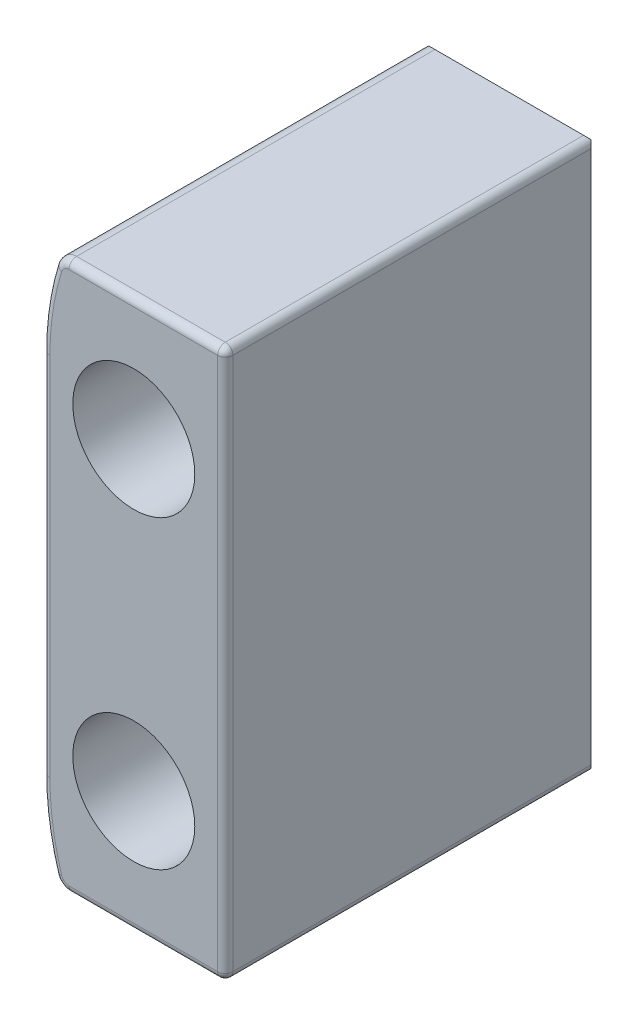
ISO-10303-21;
HEADER;
FILE_DESCRIPTION(('STEP AP214'),'2;1');
FILE_NAME('part.step','',(''),(''),'','','');
FILE_SCHEMA(('AUTOMOTIVE_DESIGN { 1 0 10303 214 1 1 1 1 }'));
ENDSEC;
DATA;
#1=APPLICATION_CONTEXT('core data for automotive mechanical design processes');
#2=APPLICATION_PROTOCOL_DEFINITION('international standard','automotive_design',2000,#1);
#3=PRODUCT_CONTEXT('',#1,'mechanical');
#4=PRODUCT('Part','Part','',(#3));
#5=PRODUCT_RELATED_PRODUCT_CATEGORY('part','',(#4));
#6=PRODUCT_DEFINITION_FORMATION('','',#4);
#7=PRODUCT_DEFINITION_CONTEXT('part definition',#1,'design');
#8=PRODUCT_DEFINITION('design','',#6,#7);
#9=PRODUCT_DEFINITION_SHAPE('','',#8);
#10=(LENGTH_UNIT() NAMED_UNIT(*) SI_UNIT(.MILLI.,.METRE.));
#11=(NAMED_UNIT(*) PLANE_ANGLE_UNIT() SI_UNIT($,.RADIAN.));
#12=(NAMED_UNIT(*) SI_UNIT($,.STERADIAN.) SOLID_ANGLE_UNIT());
#13=UNCERTAINTY_MEASURE_WITH_UNIT(LENGTH_MEASURE(1.E-05),#10,'distance_accuracy_value','');
#14=(GEOMETRIC_REPRESENTATION_CONTEXT(3) GLOBAL_UNCERTAINTY_ASSIGNED_CONTEXT((#13)) GLOBAL_UNIT_ASSIGNED_CONTEXT((#10,
#11,#12)) REPRESENTATION_CONTEXT('',''));
#15=CARTESIAN_POINT('',(0.,0.,0.));
#16=DIRECTION('',(0.,0.,1.));
#17=DIRECTION('',(1.,0.,0.));
#18=AXIS2_PLACEMENT_3D('',#15,#16,#17);
#19=CARTESIAN_POINT('',(0.,0.,0.));
#20=DIRECTION('',(0.,0.,1.));
#21=DIRECTION('',(1.,0.,0.));
#22=AXIS2_PLACEMENT_3D('',#19,#20,#21);
#23=PLANE('',#22);
#24=CARTESIAN_POINT('',(-5.99999999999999,10.,0.));
#25=DIRECTION('',(0.,0.,1.));
#26=DIRECTION('',(1.,0.,0.));
#27=AXIS2_PLACEMENT_3D('',#24,#25,#26);
#28=CIRCLE('',#27,3.99999999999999);
#29=CARTESIAN_POINT('',(-2.,10.,0.));
#30=VERTEX_POINT('',#29);
#31=EDGE_CURVE('E527',#30,#30,#28,.T.);
#32=ORIENTED_EDGE('',*,*,#31,.F.);
#33=EDGE_LOOP('',(#32));
#34=FACE_BOUND('',#33,.T.);
#35=CARTESIAN_POINT('',(-5.99999999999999,-10.,0.));
#36=DIRECTION('',(0.,0.,1.));
#37=DIRECTION('',(1.,0.,0.));
#38=AXIS2_PLACEMENT_3D('',#35,#36,#37);
#39=CIRCLE('',#38,3.99999999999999);
#40=CARTESIAN_POINT('',(-2.,-10.,0.));
#41=VERTEX_POINT('',#40);
#42=EDGE_CURVE('E515',#41,#41,#39,.T.);
#43=ORIENTED_EDGE('',*,*,#42,.F.);
#44=EDGE_LOOP('',(#43));
#45=FACE_BOUND('',#44,.T.);
#46=CARTESIAN_POINT('',(-10.2480768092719,-17.,0.));
#47=DIRECTION('',(0.,0.,1.));
#48=DIRECTION('',(1.,0.,0.));
#49=AXIS2_PLACEMENT_3D('',#46,#47,#48);
#50=CIRCLE('',#49,0.5);
#51=CARTESIAN_POINT('',(-10.2480768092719,-17.5,0.));
#52=VERTEX_POINT('',#51);
#53=CARTESIAN_POINT('',(-10.7259614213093,-17.1470588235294,0.));
#54=VERTEX_POINT('',#53);
#55=EDGE_CURVE('E427',#52,#54,#50,.F.);
#56=ORIENTED_EDGE('',*,*,#55,.F.);
#57=DIRECTION('',(1.,0.,0.));
#58=VECTOR('',#57,1.);
#59=CARTESIAN_POINT('',(0.,-17.5,0.));
#60=LINE('',#59,#58);
#61=CARTESIAN_POINT('',(-0.499999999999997,-17.5,0.));
#62=VERTEX_POINT('',#61);
#63=EDGE_CURVE('E467',#52,#62,#60,.T.);
#64=ORIENTED_EDGE('',*,*,#63,.T.);
#65=DIRECTION('',(0.,1.,0.));
#66=VECTOR('',#65,1.);
#67=CARTESIAN_POINT('',(-0.499999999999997,0.,0.));
#68=LINE('',#67,#66);
#69=CARTESIAN_POINT('',(-0.499999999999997,17.5,0.));
#70=VERTEX_POINT('',#69);
#71=EDGE_CURVE('E471',#62,#70,#68,.T.);
#72=ORIENTED_EDGE('',*,*,#71,.T.);
#73=DIRECTION('',(-1.,0.,0.));
#74=VECTOR('',#73,1.);
#75=CARTESIAN_POINT('',(0.,17.5,0.));
#76=LINE('',#75,#74);
#77=CARTESIAN_POINT('',(-10.2480768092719,17.5,0.));
#78=VERTEX_POINT('',#77);
#79=EDGE_CURVE('E473',#70,#78,#76,.T.);
#80=ORIENTED_EDGE('',*,*,#79,.T.);
#81=CARTESIAN_POINT('',(-10.2480768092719,17.,0.));
#82=DIRECTION('',(0.,0.,1.));
#83=DIRECTION('',(1.,0.,0.));
#84=AXIS2_PLACEMENT_3D('',#81,#82,#83);
#85=CIRCLE('',#84,0.5);
#86=CARTESIAN_POINT('',(-10.7259614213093,17.1470588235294,0.));
#87=VERTEX_POINT('',#86);
#88=EDGE_CURVE('E404',#87,#78,#85,.F.);
#89=ORIENTED_EDGE('',*,*,#88,.F.);
#90=CARTESIAN_POINT('',(6.,12.,0.));
#91=DIRECTION('',(0.,0.,1.));
#92=DIRECTION('',(1.,0.,0.));
#93=AXIS2_PLACEMENT_3D('',#90,#91,#92);
#94=CIRCLE('',#93,17.5);
#95=CARTESIAN_POINT('',(-11.5,12.,0.));
#96=VERTEX_POINT('',#95);
#97=EDGE_CURVE('E479',#87,#96,#94,.T.);
#98=ORIENTED_EDGE('',*,*,#97,.T.);
#99=DIRECTION('',(0.,-1.,0.));
#100=VECTOR('',#99,1.);
#101=CARTESIAN_POINT('',(-11.5,0.,0.));
#102=LINE('',#101,#100);
#103=CARTESIAN_POINT('',(-11.5,-12.,0.));
#104=VERTEX_POINT('',#103);
#105=EDGE_CURVE('E350',#96,#104,#102,.T.);
#106=ORIENTED_EDGE('',*,*,#105,.T.);
#107=CARTESIAN_POINT('',(6.,-12.,0.));
#108=DIRECTION('',(0.,0.,1.));
#109=DIRECTION('',(1.,0.,0.));
#110=AXIS2_PLACEMENT_3D('',#107,#108,#109);
#111=CIRCLE('',#110,17.5);
#112=EDGE_CURVE('E211',#104,#54,#111,.T.);
#113=ORIENTED_EDGE('',*,*,#112,.T.);
#114=EDGE_LOOP('',(#56,#64,#72,#80,#89,#98,#106,#113));
#115=FACE_BOUND('',#114,.T.);
#116=ADVANCED_FACE('F34',(#34,#45,#115),#23,.T.);
#117=CARTESIAN_POINT('',(-12.,18.,-25.));
#118=DIRECTION('',(-1.,0.,0.));
#119=DIRECTION('',(0.,-1.,0.));
#120=AXIS2_PLACEMENT_3D('',#117,#118,#119);
#121=PLANE('',#120);
#122=DIRECTION('',(0.,0.,1.));
#123=VECTOR('',#122,1.);
#124=CARTESIAN_POINT('',(-12.,-12.,-25.));
#125=LINE('',#124,#123);
#126=CARTESIAN_POINT('',(-12.,-12.,-24.));
#127=VERTEX_POINT('',#126);
#128=CARTESIAN_POINT('',(-12.,-12.,-0.5));
#129=VERTEX_POINT('',#128);
#130=EDGE_CURVE('E369',#127,#129,#125,.T.);
#131=ORIENTED_EDGE('',*,*,#130,.T.);
#132=DIRECTION('',(0.,-1.,0.));
#133=VECTOR('',#132,1.);
#134=CARTESIAN_POINT('',(-12.,18.,-0.5));
#135=LINE('',#134,#133);
#136=CARTESIAN_POINT('',(-12.,12.,-0.5));
#137=VERTEX_POINT('',#136);
#138=EDGE_CURVE('E347',#129,#137,#135,.F.);
#139=ORIENTED_EDGE('',*,*,#138,.T.);
#140=DIRECTION('',(0.,0.,1.));
#141=VECTOR('',#140,1.);
#142=CARTESIAN_POINT('',(-12.,12.,-25.));
#143=LINE('',#142,#141);
#144=CARTESIAN_POINT('',(-12.,12.,-24.));
#145=VERTEX_POINT('',#144);
#146=EDGE_CURVE('E366',#145,#137,#143,.T.);
#147=ORIENTED_EDGE('',*,*,#146,.F.);
#148=DIRECTION('',(0.,-1.,0.));
#149=VECTOR('',#148,1.);
#150=CARTESIAN_POINT('',(-12.,-12.,-24.));
#151=LINE('',#150,#149);
#152=EDGE_CURVE('E204',#145,#127,#151,.T.);
#153=ORIENTED_EDGE('',*,*,#152,.T.);
#154=EDGE_LOOP('',(#131,#139,#147,#153));
#155=FACE_BOUND('',#154,.T.);
#156=ADVANCED_FACE('F273',(#155),#121,.T.);
#157=CARTESIAN_POINT('',(-12.,18.,-25.));
#158=DIRECTION('',(0.,1.,0.));
#159=DIRECTION('',(0.,0.,1.));
#160=AXIS2_PLACEMENT_3D('',#157,#158,#159);
#161=PLANE('',#160);
#162=DIRECTION('',(-1.,0.,0.));
#163=VECTOR('',#162,1.);
#164=CARTESIAN_POINT('',(-10.9705627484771,18.,-24.));
#165=LINE('',#164,#163);
#166=CARTESIAN_POINT('',(-0.499999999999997,18.,-24.));
#167=VERTEX_POINT('',#166);
#168=CARTESIAN_POINT('',(-10.2480768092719,18.,-24.));
#169=VERTEX_POINT('',#168);
#170=EDGE_CURVE('E194',#167,#169,#165,.T.);
#171=ORIENTED_EDGE('',*,*,#170,.T.);
#172=DIRECTION('',(0.,0.,-1.));
#173=VECTOR('',#172,1.);
#174=CARTESIAN_POINT('',(-10.2480768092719,18.,-0.5));
#175=LINE('',#174,#173);
#176=CARTESIAN_POINT('',(-10.2480768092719,18.,-0.5));
#177=VERTEX_POINT('',#176);
#178=EDGE_CURVE('E438',#169,#177,#175,.F.);
#179=ORIENTED_EDGE('',*,*,#178,.T.);
#180=DIRECTION('',(-1.,0.,0.));
#181=VECTOR('',#180,1.);
#182=CARTESIAN_POINT('',(-12.,18.,-0.5));
#183=LINE('',#182,#181);
#184=CARTESIAN_POINT('',(-0.499999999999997,18.,-0.5));
#185=VERTEX_POINT('',#184);
#186=EDGE_CURVE('E483',#177,#185,#183,.F.);
#187=ORIENTED_EDGE('',*,*,#186,.T.);
#188=DIRECTION('',(0.,0.,1.));
#189=VECTOR('',#188,1.);
#190=CARTESIAN_POINT('',(-0.499999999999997,18.,-25.));
#191=LINE('',#190,#189);
#192=EDGE_CURVE('E362',#185,#167,#191,.F.);
#193=ORIENTED_EDGE('',*,*,#192,.T.);
#194=EDGE_LOOP('',(#171,#179,#187,#193));
#195=FACE_BOUND('',#194,.T.);
#196=ADVANCED_FACE('F279',(#195),#161,.T.);
#197=CARTESIAN_POINT('',(0.,18.,-25.));
#198=DIRECTION('',(1.,0.,0.));
#199=DIRECTION('',(0.,0.,-1.));
#200=AXIS2_PLACEMENT_3D('',#197,#198,#199);
#201=PLANE('',#200);
#202=DIRECTION('',(0.,1.,0.));
#203=VECTOR('',#202,1.);
#204=CARTESIAN_POINT('',(0.,18.,-24.));
#205=LINE('',#204,#203);
#206=CARTESIAN_POINT('',(0.,-17.5,-24.));
#207=VERTEX_POINT('',#206);
#208=CARTESIAN_POINT('',(0.,17.5,-24.));
#209=VERTEX_POINT('',#208);
#210=EDGE_CURVE('E189',#207,#209,#205,.T.);
#211=ORIENTED_EDGE('',*,*,#210,.T.);
#212=DIRECTION('',(0.,0.,1.));
#213=VECTOR('',#212,1.);
#214=CARTESIAN_POINT('',(0.,17.5,-25.));
#215=LINE('',#214,#213);
#216=CARTESIAN_POINT('',(0.,17.5,-0.5));
#217=VERTEX_POINT('',#216);
#218=EDGE_CURVE('E401',#209,#217,#215,.T.);
#219=ORIENTED_EDGE('',*,*,#218,.T.);
#220=DIRECTION('',(0.,1.,0.));
#221=VECTOR('',#220,1.);
#222=CARTESIAN_POINT('',(0.,18.,-0.5));
#223=LINE('',#222,#221);
#224=CARTESIAN_POINT('',(0.,-17.5,-0.5));
#225=VERTEX_POINT('',#224);
#226=EDGE_CURVE('E487',#217,#225,#223,.F.);
#227=ORIENTED_EDGE('',*,*,#226,.T.);
#228=DIRECTION('',(0.,0.,1.));
#229=VECTOR('',#228,1.);
#230=CARTESIAN_POINT('',(0.,-17.5,-25.));
#231=LINE('',#230,#229);
#232=EDGE_CURVE('E485',#225,#207,#231,.F.);
#233=ORIENTED_EDGE('',*,*,#232,.T.);
#234=EDGE_LOOP('',(#211,#219,#227,#233));
#235=FACE_BOUND('',#234,.T.);
#236=ADVANCED_FACE('F289',(#235),#201,.T.);
#237=CARTESIAN_POINT('',(-12.,-18.,-25.));
#238=DIRECTION('',(0.,-1.,0.));
#239=DIRECTION('',(0.,0.,-1.));
#240=AXIS2_PLACEMENT_3D('',#237,#238,#239);
#241=PLANE('',#240);
#242=DIRECTION('',(1.,0.,0.));
#243=VECTOR('',#242,1.);
#244=CARTESIAN_POINT('',(-12.,-18.,-0.5));
#245=LINE('',#244,#243);
#246=CARTESIAN_POINT('',(-0.499999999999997,-18.,-0.5));
#247=VERTEX_POINT('',#246);
#248=CARTESIAN_POINT('',(-10.2480768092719,-18.,-0.5));
#249=VERTEX_POINT('',#248);
#250=EDGE_CURVE('E460',#247,#249,#245,.F.);
#251=ORIENTED_EDGE('',*,*,#250,.T.);
#252=DIRECTION('',(0.,0.,-1.));
#253=VECTOR('',#252,1.);
#254=CARTESIAN_POINT('',(-10.2480768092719,-18.,-24.));
#255=LINE('',#254,#253);
#256=CARTESIAN_POINT('',(-10.2480768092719,-18.,-24.));
#257=VERTEX_POINT('',#256);
#258=EDGE_CURVE('E59',#249,#257,#255,.T.);
#259=ORIENTED_EDGE('',*,*,#258,.T.);
#260=DIRECTION('',(1.,0.,0.));
#261=VECTOR('',#260,1.);
#262=CARTESIAN_POINT('',(0.,-18.,-24.));
#263=LINE('',#262,#261);
#264=CARTESIAN_POINT('',(-0.499999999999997,-18.,-24.));
#265=VERTEX_POINT('',#264);
#266=EDGE_CURVE('E209',#257,#265,#263,.T.);
#267=ORIENTED_EDGE('',*,*,#266,.T.);
#268=DIRECTION('',(0.,0.,1.));
#269=VECTOR('',#268,1.);
#270=CARTESIAN_POINT('',(-0.499999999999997,-18.,-25.));
#271=LINE('',#270,#269);
#272=EDGE_CURVE('E490',#265,#247,#271,.T.);
#273=ORIENTED_EDGE('',*,*,#272,.T.);
#274=EDGE_LOOP('',(#251,#259,#267,#273));
#275=FACE_BOUND('',#274,.T.);
#276=ADVANCED_FACE('F293',(#275),#241,.T.);
#277=CARTESIAN_POINT('',(0.,0.,-25.));
#278=DIRECTION('',(0.,0.,1.));
#279=DIRECTION('',(1.,0.,0.));
#280=AXIS2_PLACEMENT_3D('',#277,#278,#279);
#281=PLANE('',#280);
#282=CARTESIAN_POINT('',(-5.99999999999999,10.,-25.));
#283=DIRECTION('',(0.,0.,1.));
#284=DIRECTION('',(1.,0.,0.));
#285=AXIS2_PLACEMENT_3D('',#282,#283,#284);
#286=CIRCLE('',#285,2.49999999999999);
#287=CARTESIAN_POINT('',(-3.5,10.,-25.));
#288=VERTEX_POINT('',#287);
#289=EDGE_CURVE('E518',#288,#288,#286,.T.);
#290=ORIENTED_EDGE('',*,*,#289,.T.);
#291=EDGE_LOOP('',(#290));
#292=FACE_BOUND('',#291,.T.);
#293=CARTESIAN_POINT('',(-5.99999999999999,-10.,-25.));
#294=DIRECTION('',(0.,0.,1.));
#295=DIRECTION('',(1.,0.,0.));
#296=AXIS2_PLACEMENT_3D('',#293,#294,#295);
#297=CIRCLE('',#296,2.49999999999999);
#298=CARTESIAN_POINT('',(-3.5,-10.,-25.));
#299=VERTEX_POINT('',#298);
#300=EDGE_CURVE('E504',#299,#299,#297,.T.);
#301=ORIENTED_EDGE('',*,*,#300,.T.);
#302=EDGE_LOOP('',(#301));
#303=FACE_BOUND('',#302,.T.);
#304=DIRECTION('',(1.,0.,0.));
#305=VECTOR('',#304,1.);
#306=CARTESIAN_POINT('',(0.,17.,-25.));
#307=LINE('',#306,#305);
#308=CARTESIAN_POINT('',(-10.2480768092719,17.,-25.));
#309=VERTEX_POINT('',#308);
#310=CARTESIAN_POINT('',(-1.00000000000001,17.,-25.));
#311=VERTEX_POINT('',#310);
#312=EDGE_CURVE('E193',#309,#311,#307,.T.);
#313=ORIENTED_EDGE('',*,*,#312,.T.);
#314=DIRECTION('',(0.,-1.,0.));
#315=VECTOR('',#314,1.);
#316=CARTESIAN_POINT('',(-1.00000000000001,-18.,-25.));
#317=LINE('',#316,#315);
#318=CARTESIAN_POINT('',(-1.00000000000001,-17.,-25.));
#319=VERTEX_POINT('',#318);
#320=EDGE_CURVE('E172',#311,#319,#317,.T.);
#321=ORIENTED_EDGE('',*,*,#320,.T.);
#322=DIRECTION('',(-1.,0.,0.));
#323=VECTOR('',#322,1.);
#324=CARTESIAN_POINT('',(-10.9705627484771,-17.,-25.));
#325=LINE('',#324,#323);
#326=CARTESIAN_POINT('',(-10.2480768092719,-17.,-25.));
#327=VERTEX_POINT('',#326);
#328=EDGE_CURVE('E183',#319,#327,#325,.T.);
#329=ORIENTED_EDGE('',*,*,#328,.T.);
#330=CARTESIAN_POINT('',(6.,-12.,-25.));
#331=DIRECTION('',(0.,0.,1.));
#332=DIRECTION('',(1.,0.,0.));
#333=AXIS2_PLACEMENT_3D('',#330,#331,#332);
#334=CIRCLE('',#333,17.);
#335=CARTESIAN_POINT('',(-11.,-12.,-25.));
#336=VERTEX_POINT('',#335);
#337=EDGE_CURVE('E188',#327,#336,#334,.F.);
#338=ORIENTED_EDGE('',*,*,#337,.T.);
#339=DIRECTION('',(0.,1.,0.));
#340=VECTOR('',#339,1.);
#341=CARTESIAN_POINT('',(-11.,12.,-25.));
#342=LINE('',#341,#340);
#343=CARTESIAN_POINT('',(-11.,12.,-25.));
#344=VERTEX_POINT('',#343);
#345=EDGE_CURVE('E384',#336,#344,#342,.T.);
#346=ORIENTED_EDGE('',*,*,#345,.T.);
#347=CARTESIAN_POINT('',(6.,12.,-25.));
#348=DIRECTION('',(0.,0.,1.));
#349=DIRECTION('',(1.,0.,0.));
#350=AXIS2_PLACEMENT_3D('',#347,#348,#349);
#351=CIRCLE('',#350,17.);
#352=EDGE_CURVE('E199',#344,#309,#351,.F.);
#353=ORIENTED_EDGE('',*,*,#352,.T.);
#354=EDGE_LOOP('',(#313,#321,#329,#338,#346,#353));
#355=FACE_BOUND('',#354,.T.);
#356=ADVANCED_FACE('F191',(#292,#303,#355),#281,.F.);
#357=CARTESIAN_POINT('',(6.,12.,-25.));
#358=DIRECTION('',(0.,0.,1.));
#359=DIRECTION('',(1.,0.,0.));
#360=AXIS2_PLACEMENT_3D('',#357,#358,#359);
#361=CYLINDRICAL_SURFACE('',#360,18.);
#362=CARTESIAN_POINT('',(6.,12.,-0.5));
#363=DIRECTION('',(0.,0.,1.));
#364=DIRECTION('',(1.,0.,0.));
#365=AXIS2_PLACEMENT_3D('',#362,#363,#364);
#366=CIRCLE('',#365,18.);
#367=CARTESIAN_POINT('',(-11.2038460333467,17.2941176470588,-0.5));
#368=VERTEX_POINT('',#367);
#369=EDGE_CURVE('E356',#137,#368,#366,.F.);
#370=ORIENTED_EDGE('',*,*,#369,.T.);
#371=DIRECTION('',(0.,0.,1.));
#372=VECTOR('',#371,1.);
#373=CARTESIAN_POINT('',(-11.2038460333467,17.2941176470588,-25.));
#374=LINE('',#373,#372);
#375=CARTESIAN_POINT('',(-11.2038460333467,17.2941176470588,-24.));
#376=VERTEX_POINT('',#375);
#377=EDGE_CURVE('E440',#368,#376,#374,.F.);
#378=ORIENTED_EDGE('',*,*,#377,.T.);
#379=CARTESIAN_POINT('',(6.,12.,-24.));
#380=DIRECTION('',(0.,0.,1.));
#381=DIRECTION('',(1.,0.,0.));
#382=AXIS2_PLACEMENT_3D('',#379,#380,#381);
#383=CIRCLE('',#382,18.);
#384=EDGE_CURVE('E197',#376,#145,#383,.T.);
#385=ORIENTED_EDGE('',*,*,#384,.T.);
#386=ORIENTED_EDGE('',*,*,#146,.T.);
#387=EDGE_LOOP('',(#370,#378,#385,#386));
#388=FACE_BOUND('',#387,.T.);
#389=ADVANCED_FACE('F371',(#388),#361,.T.);
#390=CARTESIAN_POINT('',(6.,-12.,-25.));
#391=DIRECTION('',(0.,0.,1.));
#392=DIRECTION('',(1.,0.,0.));
#393=AXIS2_PLACEMENT_3D('',#390,#391,#392);
#394=CYLINDRICAL_SURFACE('',#393,18.);
#395=CARTESIAN_POINT('',(6.,-12.,-24.));
#396=DIRECTION('',(0.,0.,1.));
#397=DIRECTION('',(1.,0.,0.));
#398=AXIS2_PLACEMENT_3D('',#395,#396,#397);
#399=CIRCLE('',#398,18.);
#400=CARTESIAN_POINT('',(-11.2038460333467,-17.2941176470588,-24.));
#401=VERTEX_POINT('',#400);
#402=EDGE_CURVE('E206',#127,#401,#399,.T.);
#403=ORIENTED_EDGE('',*,*,#402,.T.);
#404=DIRECTION('',(0.,0.,1.));
#405=VECTOR('',#404,1.);
#406=CARTESIAN_POINT('',(-11.2038460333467,-17.2941176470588,-25.));
#407=LINE('',#406,#405);
#408=CARTESIAN_POINT('',(-11.2038460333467,-17.2941176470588,-0.5));
#409=VERTEX_POINT('',#408);
#410=EDGE_CURVE('E448',#401,#409,#407,.T.);
#411=ORIENTED_EDGE('',*,*,#410,.T.);
#412=CARTESIAN_POINT('',(6.,-12.,-0.5));
#413=DIRECTION('',(0.,0.,1.));
#414=DIRECTION('',(1.,0.,0.));
#415=AXIS2_PLACEMENT_3D('',#412,#413,#414);
#416=CIRCLE('',#415,18.);
#417=EDGE_CURVE('E453',#409,#129,#416,.F.);
#418=ORIENTED_EDGE('',*,*,#417,.T.);
#419=ORIENTED_EDGE('',*,*,#130,.F.);
#420=EDGE_LOOP('',(#403,#411,#418,#419));
#421=FACE_BOUND('',#420,.T.);
#422=ADVANCED_FACE('F452',(#421),#394,.T.);
#423=CARTESIAN_POINT('',(-12.,18.,-24.));
#424=DIRECTION('',(-0.707106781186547,0.,-0.707106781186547));
#425=DIRECTION('',(0.,1.,0.));
#426=AXIS2_PLACEMENT_3D('',#423,#424,#425);
#427=PLANE('',#426);
#428=DIRECTION('',(-0.707106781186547,0.,0.707106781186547));
#429=VECTOR('',#428,1.);
#430=CARTESIAN_POINT('',(-11.,12.,-25.));
#431=LINE('',#430,#429);
#432=EDGE_CURVE('E377',#344,#145,#431,.T.);
#433=ORIENTED_EDGE('',*,*,#432,.F.);
#434=ORIENTED_EDGE('',*,*,#345,.F.);
#435=DIRECTION('',(0.707106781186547,0.,-0.707106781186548));
#436=VECTOR('',#435,1.);
#437=CARTESIAN_POINT('',(-12.,-12.,-24.));
#438=LINE('',#437,#436);
#439=EDGE_CURVE('E373',#127,#336,#438,.T.);
#440=ORIENTED_EDGE('',*,*,#439,.F.);
#441=ORIENTED_EDGE('',*,*,#152,.F.);
#442=EDGE_LOOP('',(#433,#434,#440,#441));
#443=FACE_BOUND('',#442,.T.);
#444=ADVANCED_FACE('F240',(#443),#427,.T.);
#445=CARTESIAN_POINT('',(6.,-12.,-25.));
#446=DIRECTION('',(0.,0.,1.));
#447=DIRECTION('',(1.,0.,0.));
#448=AXIS2_PLACEMENT_3D('',#445,#446,#447);
#449=CONICAL_SURFACE('',#448,17.,0.785398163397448);
#450=CARTESIAN_POINT('',(-10.9705627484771,-18.,-24.));
#451=CARTESIAN_POINT('',(-10.8522252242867,-17.8325832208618,-24.1674167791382));
#452=CARTESIAN_POINT('',(-10.7328493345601,-17.6655415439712,-24.3344584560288));
#453=CARTESIAN_POINT('',(-10.4920206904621,-17.3322082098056,-24.6677917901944));
#454=CARTESIAN_POINT('',(-10.3705679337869,-17.1659165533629,-24.834083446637));
#455=CARTESIAN_POINT('',(-10.2480768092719,-17.,-25.));
#456=B_SPLINE_CURVE_WITH_KNOTS('',3,(#450,#451,#452,#453,#454,#455),.UNSPECIFIED.,.F.,.F.,(4,2,
4),(0.,0.794045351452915,1.58809158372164),.UNSPECIFIED.);
#457=CARTESIAN_POINT('',(-10.8352779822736,-17.8094410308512,-24.1905589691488));
#458=VERTEX_POINT('',#457);
#459=EDGE_CURVE('E185',#458,#327,#456,.T.);
#460=ORIENTED_EDGE('',*,*,#459,.F.);
#461=CARTESIAN_POINT('',(-10.8352779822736,-17.8094410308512,-24.1905589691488));
#462=CARTESIAN_POINT('',(-10.869993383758,-17.7842897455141,-24.165947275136));
#463=CARTESIAN_POINT('',(-10.9039362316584,-17.7562251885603,-24.1429115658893));
#464=CARTESIAN_POINT('',(-10.9693859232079,-17.6940874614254,-24.1008076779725));
#465=CARTESIAN_POINT('',(-11.0008651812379,-17.6599573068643,-24.0817812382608));
#466=CARTESIAN_POINT('',(-11.059953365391,-17.5857648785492,-24.0489334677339));
#467=CARTESIAN_POINT('',(-11.0875351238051,-17.545664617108,-24.0351476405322));
#468=CARTESIAN_POINT('',(-11.1369487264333,-17.4607522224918,-24.0141012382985));
#469=CARTESIAN_POINT('',(-11.1588153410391,-17.4159710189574,-24.006800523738));
#470=CARTESIAN_POINT('',(-11.1821787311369,-17.3572587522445,-24.0020193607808));
#471=CARTESIAN_POINT('',(-11.1868603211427,-17.3447677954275,-24.0012630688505));
#472=CARTESIAN_POINT('',(-11.195727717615,-17.3195854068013,-24.0002537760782));
#473=CARTESIAN_POINT('',(-11.1999133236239,-17.3068938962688,-24.000000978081));
#474=CARTESIAN_POINT('',(-11.2038460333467,-17.2941176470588,-24.));
#475=B_SPLINE_CURVE_WITH_KNOTS('',3,(#461,#462,#463,#464,#465,#466,#467,#468,#469,#470,#471,
#472,#473,#474),.UNSPECIFIED.,.F.,.F.,(4,2,2,2,2,2,4),(0.,0.148421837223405,0.298319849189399,
0.449216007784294,0.599171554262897,0.639240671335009,0.679325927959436),.UNSPECIFIED.);
#476=EDGE_CURVE('E11',#458,#401,#475,.T.);
#477=ORIENTED_EDGE('',*,*,#476,.T.);
#478=ORIENTED_EDGE('',*,*,#402,.F.);
#479=ORIENTED_EDGE('',*,*,#439,.T.);
#480=ORIENTED_EDGE('',*,*,#337,.F.);
#481=EDGE_LOOP('',(#460,#477,#478,#479,#480));
#482=FACE_BOUND('',#481,.T.);
#483=ADVANCED_FACE('F236',(#482),#449,.T.);
#484=CARTESIAN_POINT('',(6.,12.,-25.));
#485=DIRECTION('',(0.,0.,1.));
#486=DIRECTION('',(1.,0.,0.));
#487=AXIS2_PLACEMENT_3D('',#484,#485,#486);
#488=CONICAL_SURFACE('',#487,17.,0.785398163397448);
#489=ORIENTED_EDGE('',*,*,#384,.F.);
#490=CARTESIAN_POINT('',(-11.2038460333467,17.2941176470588,-24.));
#491=CARTESIAN_POINT('',(-11.1971583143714,17.3158594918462,-23.9999975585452));
#492=CARTESIAN_POINT('',(-11.1897269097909,17.3373580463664,-24.0007336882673));
#493=CARTESIAN_POINT('',(-11.1734632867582,17.3797015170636,-24.0036526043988));
#494=CARTESIAN_POINT('',(-11.1646320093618,17.4005468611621,-24.0058344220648));
#495=CARTESIAN_POINT('',(-11.1363222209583,17.4615316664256,-24.0144527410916));
#496=CARTESIAN_POINT('',(-11.1149055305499,17.5005124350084,-24.0229633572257));
#497=CARTESIAN_POINT('',(-11.0679699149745,17.5741826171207,-24.0449083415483));
#498=CARTESIAN_POINT('',(-11.0424605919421,17.6088817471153,-24.0583312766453));
#499=CARTESIAN_POINT('',(-10.9882656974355,17.6737275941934,-24.0893660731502));
#500=CARTESIAN_POINT('',(-10.9595735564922,17.7038645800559,-24.1069866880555));
#501=CARTESIAN_POINT('',(-10.9145210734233,17.745848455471,-24.1361969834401));
#502=CARTESIAN_POINT('',(-10.8989538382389,17.7594594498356,-24.1465490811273));
#503=CARTESIAN_POINT('',(-10.8674121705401,17.7853902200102,-24.1680053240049));
#504=CARTESIAN_POINT('',(-10.8514397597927,17.7977152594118,-24.1791060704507));
#505=CARTESIAN_POINT('',(-10.8352779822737,17.8094410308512,-24.1905589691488));
#506=B_SPLINE_CURVE_WITH_KNOTS('',3,(#490,#491,#492,#493,#494,#495,#496,#497,#498,#499,#500,
#501,#502,#503,#504,#505),.UNSPECIFIED.,.F.,.F.,(4,2,2,2,2,2,2,4),(0.,0.0681899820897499,
0.136334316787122,0.271408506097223,0.406170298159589,0.541215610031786,0.61054745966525,
0.67958336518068),.UNSPECIFIED.);
#507=CARTESIAN_POINT('',(-10.8352779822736,17.8094410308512,-24.1905589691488));
#508=VERTEX_POINT('',#507);
#509=EDGE_CURVE('E392',#376,#508,#506,.T.);
#510=ORIENTED_EDGE('',*,*,#509,.T.);
#511=CARTESIAN_POINT('',(-10.9705627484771,18.,-24.));
#512=CARTESIAN_POINT('',(-10.8522252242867,17.8325832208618,-24.1674167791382));
#513=CARTESIAN_POINT('',(-10.7328493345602,17.6655415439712,-24.3344584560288));
#514=CARTESIAN_POINT('',(-10.4920206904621,17.3322082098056,-24.6677917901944));
#515=CARTESIAN_POINT('',(-10.3705679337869,17.1659165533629,-24.834083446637));
#516=CARTESIAN_POINT('',(-10.2480768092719,17.,-25.));
#517=B_SPLINE_CURVE_WITH_KNOTS('',3,(#511,#512,#513,#514,#515,#516),.UNSPECIFIED.,.F.,.F.,(4,2,
4),(0.,0.79404535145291,1.58809158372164),.UNSPECIFIED.);
#518=EDGE_CURVE('E179',#309,#508,#517,.F.);
#519=ORIENTED_EDGE('',*,*,#518,.F.);
#520=ORIENTED_EDGE('',*,*,#352,.F.);
#521=ORIENTED_EDGE('',*,*,#432,.T.);
#522=EDGE_LOOP('',(#489,#510,#519,#520,#521));
#523=FACE_BOUND('',#522,.T.);
#524=ADVANCED_FACE('F227',(#523),#488,.T.);
#525=CARTESIAN_POINT('',(-12.,-18.,-24.));
#526=DIRECTION('',(0.,-0.707106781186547,-0.707106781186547));
#527=DIRECTION('',(-1.,0.,0.));
#528=AXIS2_PLACEMENT_3D('',#525,#526,#527);
#529=PLANE('',#528);
#530=ORIENTED_EDGE('',*,*,#266,.F.);
#531=CARTESIAN_POINT('',(-10.2480768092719,-17.,-25.));
#532=DIRECTION('',(0.,-0.707106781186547,-0.707106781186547));
#533=DIRECTION('',(0.,-0.707106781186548,0.707106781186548));
#534=AXIS2_PLACEMENT_3D('',#531,#532,#533);
#535=ELLIPSE('',#534,1.4142135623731,1.);
#536=EDGE_CURVE('E44',#257,#458,#535,.T.);
#537=ORIENTED_EDGE('',*,*,#536,.T.);
#538=ORIENTED_EDGE('',*,*,#459,.T.);
#539=ORIENTED_EDGE('',*,*,#328,.F.);
#540=DIRECTION('',(0.577350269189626,-0.577350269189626,0.577350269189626));
#541=VECTOR('',#540,1.);
#542=CARTESIAN_POINT('',(-3.99999999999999,-14.,-28.));
#543=LINE('',#542,#541);
#544=CARTESIAN_POINT('',(-0.146446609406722,-17.8535533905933,-24.1464466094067));
#545=VERTEX_POINT('',#544);
#546=EDGE_CURVE('E167',#545,#319,#543,.F.);
#547=ORIENTED_EDGE('',*,*,#546,.F.);
#548=CARTESIAN_POINT('',(-0.499999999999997,-17.5,-24.5));
#549=DIRECTION('',(0.,-0.707106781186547,-0.707106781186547));
#550=DIRECTION('',(0.,-0.707106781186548,0.707106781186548));
#551=AXIS2_PLACEMENT_3D('',#548,#549,#550);
#552=ELLIPSE('',#551,0.707106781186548,0.5);
#553=EDGE_CURVE('E402',#545,#265,#552,.T.);
#554=ORIENTED_EDGE('',*,*,#553,.T.);
#555=EDGE_LOOP('',(#530,#537,#538,#539,#547,#554));
#556=FACE_BOUND('',#555,.T.);
#557=ADVANCED_FACE('F184',(#556),#529,.T.);
#558=CARTESIAN_POINT('',(-12.,18.,-24.));
#559=DIRECTION('',(0.,0.707106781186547,-0.707106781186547));
#560=DIRECTION('',(1.,0.,0.));
#561=AXIS2_PLACEMENT_3D('',#558,#559,#560);
#562=PLANE('',#561);
#563=ORIENTED_EDGE('',*,*,#518,.T.);
#564=CARTESIAN_POINT('',(-10.2480768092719,17.,-25.));
#565=DIRECTION('',(0.,0.707106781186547,-0.707106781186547));
#566=DIRECTION('',(0.,0.707106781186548,0.707106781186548));
#567=AXIS2_PLACEMENT_3D('',#564,#565,#566);
#568=ELLIPSE('',#567,1.4142135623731,1.);
#569=EDGE_CURVE('E446',#508,#169,#568,.T.);
#570=ORIENTED_EDGE('',*,*,#569,.T.);
#571=ORIENTED_EDGE('',*,*,#170,.F.);
#572=CARTESIAN_POINT('',(-0.499999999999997,17.5,-24.5));
#573=DIRECTION('',(0.,0.707106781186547,-0.707106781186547));
#574=DIRECTION('',(0.,0.707106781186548,0.707106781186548));
#575=AXIS2_PLACEMENT_3D('',#572,#573,#574);
#576=ELLIPSE('',#575,0.707106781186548,0.5);
#577=CARTESIAN_POINT('',(-0.146446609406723,17.8535533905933,-24.1464466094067));
#578=VERTEX_POINT('',#577);
#579=EDGE_CURVE('E395',#167,#578,#576,.T.);
#580=ORIENTED_EDGE('',*,*,#579,.T.);
#581=DIRECTION('',(-0.577350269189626,-0.577350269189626,-0.577350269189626));
#582=VECTOR('',#581,1.);
#583=CARTESIAN_POINT('',(-4.,14.,-28.));
#584=LINE('',#583,#582);
#585=EDGE_CURVE('E180',#311,#578,#584,.F.);
#586=ORIENTED_EDGE('',*,*,#585,.F.);
#587=ORIENTED_EDGE('',*,*,#312,.F.);
#588=EDGE_LOOP('',(#563,#570,#571,#580,#586,#587));
#589=FACE_BOUND('',#588,.T.);
#590=ADVANCED_FACE('F230',(#589),#562,.T.);
#591=CARTESIAN_POINT('',(0.,18.,-24.));
#592=DIRECTION('',(0.707106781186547,0.,-0.707106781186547));
#593=DIRECTION('',(0.,-1.,0.));
#594=AXIS2_PLACEMENT_3D('',#591,#592,#593);
#595=PLANE('',#594);
#596=ORIENTED_EDGE('',*,*,#585,.T.);
#597=CARTESIAN_POINT('',(-0.499999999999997,17.5,-24.5));
#598=DIRECTION('',(0.707106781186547,0.,-0.707106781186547));
#599=DIRECTION('',(0.707106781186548,0.,0.707106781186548));
#600=AXIS2_PLACEMENT_3D('',#597,#598,#599);
#601=ELLIPSE('',#600,0.707106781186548,0.5);
#602=EDGE_CURVE('E397',#578,#209,#601,.T.);
#603=ORIENTED_EDGE('',*,*,#602,.T.);
#604=ORIENTED_EDGE('',*,*,#210,.F.);
#605=CARTESIAN_POINT('',(-0.499999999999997,-17.5,-24.5));
#606=DIRECTION('',(0.707106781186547,0.,-0.707106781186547));
#607=DIRECTION('',(0.707106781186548,0.,0.707106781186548));
#608=AXIS2_PLACEMENT_3D('',#605,#606,#607);
#609=ELLIPSE('',#608,0.707106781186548,0.5);
#610=EDGE_CURVE('E176',#207,#545,#609,.T.);
#611=ORIENTED_EDGE('',*,*,#610,.T.);
#612=ORIENTED_EDGE('',*,*,#546,.T.);
#613=ORIENTED_EDGE('',*,*,#320,.F.);
#614=EDGE_LOOP('',(#596,#603,#604,#611,#612,#613));
#615=FACE_BOUND('',#614,.T.);
#616=ADVANCED_FACE('F170',(#615),#595,.T.);
#617=CARTESIAN_POINT('',(-0.499999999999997,17.5,-25.));
#618=DIRECTION('',(0.,0.,1.));
#619=DIRECTION('',(1.,0.,0.));
#620=AXIS2_PLACEMENT_3D('',#617,#618,#619);
#621=CYLINDRICAL_SURFACE('',#620,0.5);
#622=ORIENTED_EDGE('',*,*,#579,.F.);
#623=ORIENTED_EDGE('',*,*,#192,.F.);
#624=CARTESIAN_POINT('',(-0.499999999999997,17.5,-0.5));
#625=DIRECTION('',(0.,0.,1.));
#626=DIRECTION('',(1.,0.,0.));
#627=AXIS2_PLACEMENT_3D('',#624,#625,#626);
#628=CIRCLE('',#627,0.5);
#629=EDGE_CURVE('E212',#217,#185,#628,.T.);
#630=ORIENTED_EDGE('',*,*,#629,.F.);
#631=ORIENTED_EDGE('',*,*,#218,.F.);
#632=ORIENTED_EDGE('',*,*,#602,.F.);
#633=EDGE_LOOP('',(#622,#623,#630,#631,#632));
#634=FACE_BOUND('',#633,.T.);
#635=ADVANCED_FACE('F297',(#634),#621,.T.);
#636=CARTESIAN_POINT('',(-0.499999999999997,0.,-0.5));
#637=DIRECTION('',(0.,1.,0.));
#638=DIRECTION('',(0.,0.,1.));
#639=AXIS2_PLACEMENT_3D('',#636,#637,#638);
#640=CYLINDRICAL_SURFACE('',#639,0.5);
#641=CARTESIAN_POINT('',(-0.499999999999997,-17.5,-0.5));
#642=DIRECTION('',(0.,-1.,0.));
#643=DIRECTION('',(0.,0.,-1.));
#644=AXIS2_PLACEMENT_3D('',#641,#642,#643);
#645=CIRCLE('',#644,0.5);
#646=EDGE_CURVE('E418',#225,#62,#645,.T.);
#647=ORIENTED_EDGE('',*,*,#646,.F.);
#648=ORIENTED_EDGE('',*,*,#226,.F.);
#649=CARTESIAN_POINT('',(-0.499999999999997,17.5,-0.5));
#650=DIRECTION('',(0.,1.,0.));
#651=DIRECTION('',(0.,0.,1.));
#652=AXIS2_PLACEMENT_3D('',#649,#650,#651);
#653=CIRCLE('',#652,0.5);
#654=EDGE_CURVE('E421',#70,#217,#653,.T.);
#655=ORIENTED_EDGE('',*,*,#654,.F.);
#656=ORIENTED_EDGE('',*,*,#71,.F.);
#657=EDGE_LOOP('',(#647,#648,#655,#656));
#658=FACE_BOUND('',#657,.T.);
#659=ADVANCED_FACE('F301',(#658),#640,.T.);
#660=CARTESIAN_POINT('',(-0.499999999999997,-17.5,-25.));
#661=DIRECTION('',(0.,0.,1.));
#662=DIRECTION('',(1.,0.,0.));
#663=AXIS2_PLACEMENT_3D('',#660,#661,#662);
#664=CYLINDRICAL_SURFACE('',#663,0.5);
#665=ORIENTED_EDGE('',*,*,#610,.F.);
#666=ORIENTED_EDGE('',*,*,#232,.F.);
#667=CARTESIAN_POINT('',(-0.499999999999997,-17.5,-0.5));
#668=DIRECTION('',(0.,0.,1.));
#669=DIRECTION('',(1.,0.,0.));
#670=AXIS2_PLACEMENT_3D('',#667,#668,#669);
#671=CIRCLE('',#670,0.5);
#672=EDGE_CURVE('E415',#247,#225,#671,.T.);
#673=ORIENTED_EDGE('',*,*,#672,.F.);
#674=ORIENTED_EDGE('',*,*,#272,.F.);
#675=ORIENTED_EDGE('',*,*,#553,.F.);
#676=EDGE_LOOP('',(#665,#666,#673,#674,#675));
#677=FACE_BOUND('',#676,.T.);
#678=ADVANCED_FACE('F306',(#677),#664,.T.);
#679=CARTESIAN_POINT('',(-0.499999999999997,17.5,-0.5));
#680=DIRECTION('',(0.,0.,1.));
#681=DIRECTION('',(1.,0.,0.));
#682=AXIS2_PLACEMENT_3D('',#679,#680,#681);
#683=SPHERICAL_SURFACE('',#682,0.5);
#684=ORIENTED_EDGE('',*,*,#654,.T.);
#685=ORIENTED_EDGE('',*,*,#629,.T.);
#686=CARTESIAN_POINT('',(-0.499999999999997,17.5,-0.5));
#687=DIRECTION('',(1.,0.,0.));
#688=DIRECTION('',(0.,0.,-1.));
#689=AXIS2_PLACEMENT_3D('',#686,#687,#688);
#690=CIRCLE('',#689,0.5);
#691=EDGE_CURVE('E412',#70,#185,#690,.F.);
#692=ORIENTED_EDGE('',*,*,#691,.F.);
#693=EDGE_LOOP('',(#684,#685,#692));
#694=FACE_BOUND('',#693,.T.);
#695=ADVANCED_FACE('F313',(#694),#683,.T.);
#696=CARTESIAN_POINT('',(-0.499999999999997,-17.5,-0.5));
#697=DIRECTION('',(0.,0.,1.));
#698=DIRECTION('',(1.,0.,0.));
#699=AXIS2_PLACEMENT_3D('',#696,#697,#698);
#700=SPHERICAL_SURFACE('',#699,0.5);
#701=ORIENTED_EDGE('',*,*,#672,.T.);
#702=ORIENTED_EDGE('',*,*,#646,.T.);
#703=CARTESIAN_POINT('',(-0.499999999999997,-17.5,-0.5));
#704=DIRECTION('',(1.,0.,0.));
#705=DIRECTION('',(0.,1.,0.));
#706=AXIS2_PLACEMENT_3D('',#703,#704,#705);
#707=CIRCLE('',#706,0.5);
#708=EDGE_CURVE('E352',#247,#62,#707,.F.);
#709=ORIENTED_EDGE('',*,*,#708,.F.);
#710=EDGE_LOOP('',(#701,#702,#709));
#711=FACE_BOUND('',#710,.T.);
#712=ADVANCED_FACE('F317',(#711),#700,.T.);
#713=CARTESIAN_POINT('',(0.,17.5,-0.5));
#714=DIRECTION('',(-1.,0.,0.));
#715=DIRECTION('',(0.,0.,1.));
#716=AXIS2_PLACEMENT_3D('',#713,#714,#715);
#717=CYLINDRICAL_SURFACE('',#716,0.5);
#718=ORIENTED_EDGE('',*,*,#186,.F.);
#719=CARTESIAN_POINT('',(-10.2480768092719,17.5,-0.5));
#720=DIRECTION('',(1.,0.,0.));
#721=DIRECTION('',(0.,0.,-1.));
#722=AXIS2_PLACEMENT_3D('',#719,#720,#721);
#723=CIRCLE('',#722,0.5);
#724=EDGE_CURVE('E432',#177,#78,#723,.T.);
#725=ORIENTED_EDGE('',*,*,#724,.T.);
#726=ORIENTED_EDGE('',*,*,#79,.F.);
#727=ORIENTED_EDGE('',*,*,#691,.T.);
#728=EDGE_LOOP('',(#718,#725,#726,#727));
#729=FACE_BOUND('',#728,.T.);
#730=ADVANCED_FACE('F321',(#729),#717,.T.);
#731=CARTESIAN_POINT('',(0.,-17.5,-0.5));
#732=DIRECTION('',(1.,0.,0.));
#733=DIRECTION('',(0.,0.,-1.));
#734=AXIS2_PLACEMENT_3D('',#731,#732,#733);
#735=CYLINDRICAL_SURFACE('',#734,0.5);
#736=ORIENTED_EDGE('',*,*,#63,.F.);
#737=CARTESIAN_POINT('',(-10.2480768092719,-17.5,-0.5));
#738=DIRECTION('',(1.,0.,0.));
#739=DIRECTION('',(0.,0.,-1.));
#740=AXIS2_PLACEMENT_3D('',#737,#738,#739);
#741=CIRCLE('',#740,0.5);
#742=EDGE_CURVE('E436',#52,#249,#741,.T.);
#743=ORIENTED_EDGE('',*,*,#742,.T.);
#744=ORIENTED_EDGE('',*,*,#250,.F.);
#745=ORIENTED_EDGE('',*,*,#708,.T.);
#746=EDGE_LOOP('',(#736,#743,#744,#745));
#747=FACE_BOUND('',#746,.T.);
#748=ADVANCED_FACE('F327',(#747),#735,.T.);
#749=CARTESIAN_POINT('',(6.,12.,-0.5));
#750=DIRECTION('',(0.,0.,1.));
#751=DIRECTION('',(1.,0.,0.));
#752=AXIS2_PLACEMENT_3D('',#749,#750,#751);
#753=TOROIDAL_SURFACE('',#752,17.5,0.5);
#754=ORIENTED_EDGE('',*,*,#97,.F.);
#755=CARTESIAN_POINT('',(-10.7259614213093,17.1470588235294,-0.5));
#756=DIRECTION('',(-0.294117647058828,-0.955769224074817,0.));
#757=DIRECTION('',(0.955769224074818,-0.294117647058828,0.));
#758=AXIS2_PLACEMENT_3D('',#755,#756,#757);
#759=CIRCLE('',#758,0.5);
#760=EDGE_CURVE('E358',#87,#368,#759,.T.);
#761=ORIENTED_EDGE('',*,*,#760,.T.);
#762=ORIENTED_EDGE('',*,*,#369,.F.);
#763=CARTESIAN_POINT('',(-11.5,12.,-0.5));
#764=DIRECTION('',(0.,-1.,0.));
#765=DIRECTION('',(0.,0.,-1.));
#766=AXIS2_PLACEMENT_3D('',#763,#764,#765);
#767=CIRCLE('',#766,0.5);
#768=EDGE_CURVE('E344',#96,#137,#767,.T.);
#769=ORIENTED_EDGE('',*,*,#768,.F.);
#770=EDGE_LOOP('',(#754,#761,#762,#769));
#771=FACE_BOUND('',#770,.T.);
#772=ADVANCED_FACE('F323',(#771),#753,.T.);
#773=CARTESIAN_POINT('',(6.,-12.,-0.5));
#774=DIRECTION('',(0.,0.,1.));
#775=DIRECTION('',(1.,0.,0.));
#776=AXIS2_PLACEMENT_3D('',#773,#774,#775);
#777=TOROIDAL_SURFACE('',#776,17.5,0.5);
#778=ORIENTED_EDGE('',*,*,#417,.F.);
#779=CARTESIAN_POINT('',(-10.7259614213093,-17.1470588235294,-0.5));
#780=DIRECTION('',(-0.294117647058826,0.955769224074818,0.));
#781=DIRECTION('',(-0.955769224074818,-0.294117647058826,0.));
#782=AXIS2_PLACEMENT_3D('',#779,#780,#781);
#783=CIRCLE('',#782,0.5);
#784=EDGE_CURVE('E430',#409,#54,#783,.T.);
#785=ORIENTED_EDGE('',*,*,#784,.T.);
#786=ORIENTED_EDGE('',*,*,#112,.F.);
#787=CARTESIAN_POINT('',(-11.5,-12.,-0.5));
#788=DIRECTION('',(0.,1.,0.));
#789=DIRECTION('',(0.,0.,1.));
#790=AXIS2_PLACEMENT_3D('',#787,#788,#789);
#791=CIRCLE('',#790,0.5);
#792=EDGE_CURVE('E353',#129,#104,#791,.T.);
#793=ORIENTED_EDGE('',*,*,#792,.F.);
#794=EDGE_LOOP('',(#778,#785,#786,#793));
#795=FACE_BOUND('',#794,.T.);
#796=ADVANCED_FACE('F326',(#795),#777,.T.);
#797=CARTESIAN_POINT('',(-11.5,0.,-0.5));
#798=DIRECTION('',(0.,-1.,0.));
#799=DIRECTION('',(1.,0.,0.));
#800=AXIS2_PLACEMENT_3D('',#797,#798,#799);
#801=CYLINDRICAL_SURFACE('',#800,0.5);
#802=ORIENTED_EDGE('',*,*,#768,.T.);
#803=ORIENTED_EDGE('',*,*,#138,.F.);
#804=ORIENTED_EDGE('',*,*,#792,.T.);
#805=ORIENTED_EDGE('',*,*,#105,.F.);
#806=EDGE_LOOP('',(#802,#803,#804,#805));
#807=FACE_BOUND('',#806,.T.);
#808=ADVANCED_FACE('F256',(#807),#801,.T.);
#809=CARTESIAN_POINT('',(-10.2480768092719,-17.,-25.));
#810=DIRECTION('',(0.,0.,1.));
#811=DIRECTION('',(1.,0.,0.));
#812=AXIS2_PLACEMENT_3D('',#809,#810,#811);
#813=CYLINDRICAL_SURFACE('',#812,1.);
#814=ORIENTED_EDGE('',*,*,#536,.F.);
#815=ORIENTED_EDGE('',*,*,#258,.F.);
#816=CARTESIAN_POINT('',(-10.2480768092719,-17.,-0.5));
#817=DIRECTION('',(0.,0.,1.));
#818=DIRECTION('',(1.,0.,0.));
#819=AXIS2_PLACEMENT_3D('',#816,#817,#818);
#820=CIRCLE('',#819,1.);
#821=EDGE_CURVE('E250',#409,#249,#820,.T.);
#822=ORIENTED_EDGE('',*,*,#821,.F.);
#823=ORIENTED_EDGE('',*,*,#410,.F.);
#824=ORIENTED_EDGE('',*,*,#476,.F.);
#825=EDGE_LOOP('',(#814,#815,#822,#823,#824));
#826=FACE_BOUND('',#825,.T.);
#827=ADVANCED_FACE('F251',(#826),#813,.T.);
#828=CARTESIAN_POINT('',(-10.2480768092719,-17.,-0.5));
#829=DIRECTION('',(0.,0.,1.));
#830=DIRECTION('',(1.,0.,0.));
#831=AXIS2_PLACEMENT_3D('',#828,#829,#830);
#832=DEGENERATE_TOROIDAL_SURFACE('',#831,0.5,0.5,.T.);
#833=ORIENTED_EDGE('',*,*,#742,.F.);
#834=ORIENTED_EDGE('',*,*,#55,.T.);
#835=ORIENTED_EDGE('',*,*,#784,.F.);
#836=ORIENTED_EDGE('',*,*,#821,.T.);
#837=EDGE_LOOP('',(#833,#834,#835,#836));
#838=FACE_BOUND('',#837,.T.);
#839=ADVANCED_FACE('F255',(#838),#832,.T.);
#840=CARTESIAN_POINT('',(-10.2480768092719,17.,-25.));
#841=DIRECTION('',(0.,0.,1.));
#842=DIRECTION('',(1.,0.,0.));
#843=AXIS2_PLACEMENT_3D('',#840,#841,#842);
#844=CYLINDRICAL_SURFACE('',#843,1.);
#845=ORIENTED_EDGE('',*,*,#509,.F.);
#846=ORIENTED_EDGE('',*,*,#377,.F.);
#847=CARTESIAN_POINT('',(-10.2480768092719,17.,-0.5));
#848=DIRECTION('',(0.,0.,1.));
#849=DIRECTION('',(1.,0.,0.));
#850=AXIS2_PLACEMENT_3D('',#847,#848,#849);
#851=CIRCLE('',#850,1.);
#852=EDGE_CURVE('E39',#177,#368,#851,.T.);
#853=ORIENTED_EDGE('',*,*,#852,.F.);
#854=ORIENTED_EDGE('',*,*,#178,.F.);
#855=ORIENTED_EDGE('',*,*,#569,.F.);
#856=EDGE_LOOP('',(#845,#846,#853,#854,#855));
#857=FACE_BOUND('',#856,.T.);
#858=ADVANCED_FACE('F36',(#857),#844,.T.);
#859=CARTESIAN_POINT('',(-10.2480768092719,17.,-0.5));
#860=DIRECTION('',(0.,0.,1.));
#861=DIRECTION('',(1.,0.,0.));
#862=AXIS2_PLACEMENT_3D('',#859,#860,#861);
#863=DEGENERATE_TOROIDAL_SURFACE('',#862,0.5,0.5,.T.);
#864=ORIENTED_EDGE('',*,*,#724,.F.);
#865=ORIENTED_EDGE('',*,*,#852,.T.);
#866=ORIENTED_EDGE('',*,*,#760,.F.);
#867=ORIENTED_EDGE('',*,*,#88,.T.);
#868=EDGE_LOOP('',(#864,#865,#866,#867));
#869=FACE_BOUND('',#868,.T.);
#870=ADVANCED_FACE('F259',(#869),#863,.T.);
#871=CARTESIAN_POINT('',(-5.99999999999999,-10.,0.));
#872=DIRECTION('',(0.,0.,1.));
#873=DIRECTION('',(1.,0.,0.));
#874=AXIS2_PLACEMENT_3D('',#871,#872,#873);
#875=CYLINDRICAL_SURFACE('',#874,2.5);
#876=ORIENTED_EDGE('',*,*,#300,.F.);
#877=EDGE_LOOP('',(#876));
#878=FACE_BOUND('',#877,.T.);
#879=CARTESIAN_POINT('',(-5.99999999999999,-10.,-6.));
#880=DIRECTION('',(0.,0.,1.));
#881=DIRECTION('',(1.,0.,0.));
#882=AXIS2_PLACEMENT_3D('',#879,#880,#881);
#883=CIRCLE('',#882,2.5);
#884=CARTESIAN_POINT('',(-3.49999999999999,-10.,-6.));
#885=VERTEX_POINT('',#884);
#886=EDGE_CURVE('E506',#885,#885,#883,.T.);
#887=ORIENTED_EDGE('',*,*,#886,.T.);
#888=EDGE_LOOP('',(#887));
#889=FACE_BOUND('',#888,.T.);
#890=ADVANCED_FACE('F261',(#878,#889),#875,.F.);
#891=CARTESIAN_POINT('',(-3.49999999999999,-10.,-6.));
#892=DIRECTION('',(0.,0.,-1.));
#893=DIRECTION('',(-1.,0.,0.));
#894=AXIS2_PLACEMENT_3D('',#891,#892,#893);
#895=PLANE('',#894);
#896=ORIENTED_EDGE('',*,*,#886,.F.);
#897=EDGE_LOOP('',(#896));
#898=FACE_BOUND('',#897,.T.);
#899=CARTESIAN_POINT('',(-5.99999999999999,-10.,-6.));
#900=DIRECTION('',(0.,0.,1.));
#901=DIRECTION('',(1.,0.,0.));
#902=AXIS2_PLACEMENT_3D('',#899,#900,#901);
#903=CIRCLE('',#902,4.);
#904=CARTESIAN_POINT('',(-1.99999999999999,-10.,-6.));
#905=VERTEX_POINT('',#904);
#906=EDGE_CURVE('E510',#905,#905,#903,.T.);
#907=ORIENTED_EDGE('',*,*,#906,.T.);
#908=EDGE_LOOP('',(#907));
#909=FACE_BOUND('',#908,.T.);
#910=ADVANCED_FACE('F267',(#898,#909),#895,.F.);
#911=CARTESIAN_POINT('',(-5.99999999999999,-10.,0.));
#912=DIRECTION('',(0.,0.,1.));
#913=DIRECTION('',(1.,0.,0.));
#914=AXIS2_PLACEMENT_3D('',#911,#912,#913);
#915=CYLINDRICAL_SURFACE('',#914,4.);
#916=ORIENTED_EDGE('',*,*,#906,.F.);
#917=EDGE_LOOP('',(#916));
#918=FACE_BOUND('',#917,.T.);
#919=ORIENTED_EDGE('',*,*,#42,.T.);
#920=EDGE_LOOP('',(#919));
#921=FACE_BOUND('',#920,.T.);
#922=ADVANCED_FACE('F545',(#918,#921),#915,.F.);
#923=CARTESIAN_POINT('',(-5.99999999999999,10.,0.));
#924=DIRECTION('',(0.,0.,1.));
#925=DIRECTION('',(1.,0.,0.));
#926=AXIS2_PLACEMENT_3D('',#923,#924,#925);
#927=CYLINDRICAL_SURFACE('',#926,2.5);
#928=ORIENTED_EDGE('',*,*,#289,.F.);
#929=EDGE_LOOP('',(#928));
#930=FACE_BOUND('',#929,.T.);
#931=CARTESIAN_POINT('',(-5.99999999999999,10.,-6.));
#932=DIRECTION('',(0.,0.,1.));
#933=DIRECTION('',(1.,0.,0.));
#934=AXIS2_PLACEMENT_3D('',#931,#932,#933);
#935=CIRCLE('',#934,2.5);
#936=CARTESIAN_POINT('',(-3.49999999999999,10.,-6.));
#937=VERTEX_POINT('',#936);
#938=EDGE_CURVE('E521',#937,#937,#935,.T.);
#939=ORIENTED_EDGE('',*,*,#938,.T.);
#940=EDGE_LOOP('',(#939));
#941=FACE_BOUND('',#940,.T.);
#942=ADVANCED_FACE('F538',(#930,#941),#927,.F.);
#943=CARTESIAN_POINT('',(-3.49999999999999,10.,-6.));
#944=DIRECTION('',(0.,0.,-1.));
#945=DIRECTION('',(-1.,0.,0.));
#946=AXIS2_PLACEMENT_3D('',#943,#944,#945);
#947=PLANE('',#946);
#948=ORIENTED_EDGE('',*,*,#938,.F.);
#949=EDGE_LOOP('',(#948));
#950=FACE_BOUND('',#949,.T.);
#951=CARTESIAN_POINT('',(-5.99999999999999,10.,-6.));
#952=DIRECTION('',(0.,0.,1.));
#953=DIRECTION('',(1.,0.,0.));
#954=AXIS2_PLACEMENT_3D('',#951,#952,#953);
#955=CIRCLE('',#954,4.);
#956=CARTESIAN_POINT('',(-1.99999999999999,10.,-6.));
#957=VERTEX_POINT('',#956);
#958=EDGE_CURVE('E524',#957,#957,#955,.T.);
#959=ORIENTED_EDGE('',*,*,#958,.T.);
#960=EDGE_LOOP('',(#959));
#961=FACE_BOUND('',#960,.T.);
#962=ADVANCED_FACE('F532',(#950,#961),#947,.F.);
#963=CARTESIAN_POINT('',(-5.99999999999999,10.,0.));
#964=DIRECTION('',(0.,0.,1.));
#965=DIRECTION('',(1.,0.,0.));
#966=AXIS2_PLACEMENT_3D('',#963,#964,#965);
#967=CYLINDRICAL_SURFACE('',#966,4.);
#968=ORIENTED_EDGE('',*,*,#958,.F.);
#969=EDGE_LOOP('',(#968));
#970=FACE_BOUND('',#969,.T.);
#971=ORIENTED_EDGE('',*,*,#31,.T.);
#972=EDGE_LOOP('',(#971));
#973=FACE_BOUND('',#972,.T.);
#974=ADVANCED_FACE('F530',(#970,#973),#967,.F.);
#975=CLOSED_SHELL('',(#116,#156,#196,#236,#276,#356,#389,#422,#444,#483,#524,#557,#590,#616,
#635,#659,#678,#695,#712,#730,#748,#772,#796,#808,#827,#839,#858,#870,#890,#910,#922,#942,#962,#974));
#976=MANIFOLD_SOLID_BREP('B2',#975);
#977=ADVANCED_BREP_SHAPE_REPRESENTATION('',(#18,#976),#14);
#978=SHAPE_DEFINITION_REPRESENTATION(#9,#977);
ENDSEC;
END-ISO-10303-21;
